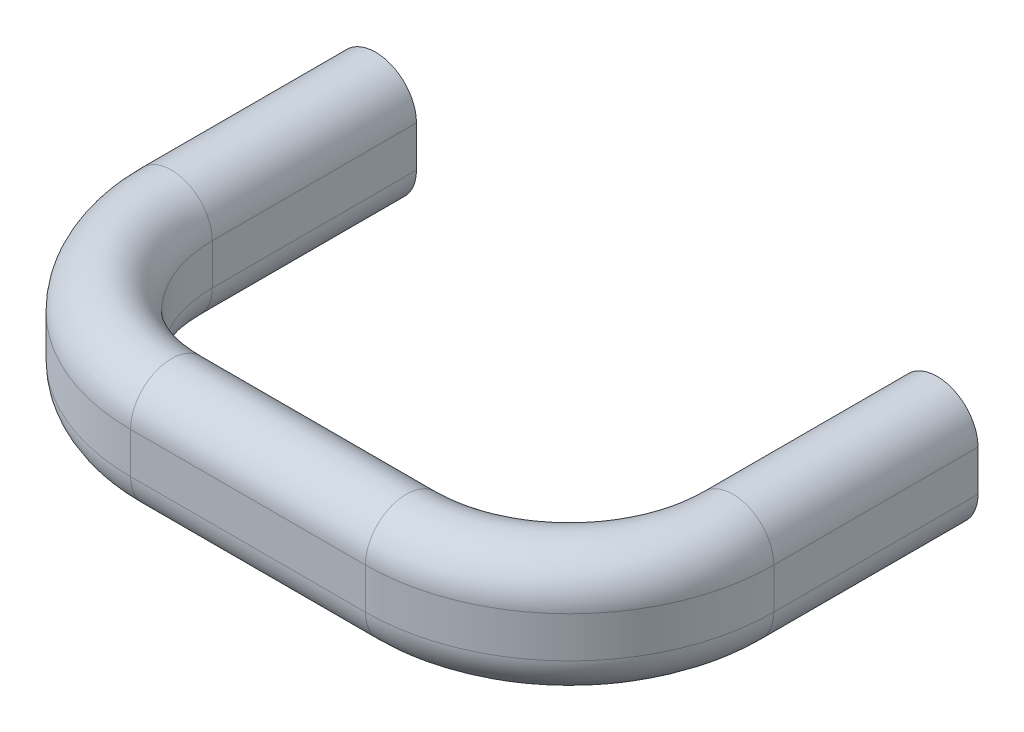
ISO-10303-21;
HEADER;
FILE_DESCRIPTION(('STEP AP214'),'2;1');
FILE_NAME('part.step','',(''),(''),'','','');
FILE_SCHEMA(('AUTOMOTIVE_DESIGN { 1 0 10303 214 1 1 1 1 }'));
ENDSEC;
DATA;
#1=APPLICATION_CONTEXT('core data for automotive mechanical design processes');
#2=APPLICATION_PROTOCOL_DEFINITION('international standard','automotive_design',2000,#1);
#3=PRODUCT_CONTEXT('',#1,'mechanical');
#4=PRODUCT('Part','Part','',(#3));
#5=PRODUCT_RELATED_PRODUCT_CATEGORY('part','',(#4));
#6=PRODUCT_DEFINITION_FORMATION('','',#4);
#7=PRODUCT_DEFINITION_CONTEXT('part definition',#1,'design');
#8=PRODUCT_DEFINITION('design','',#6,#7);
#9=PRODUCT_DEFINITION_SHAPE('','',#8);
#10=(LENGTH_UNIT() NAMED_UNIT(*) SI_UNIT(.MILLI.,.METRE.));
#11=(NAMED_UNIT(*) PLANE_ANGLE_UNIT() SI_UNIT($,.RADIAN.));
#12=(NAMED_UNIT(*) SI_UNIT($,.STERADIAN.) SOLID_ANGLE_UNIT());
#13=UNCERTAINTY_MEASURE_WITH_UNIT(LENGTH_MEASURE(1.E-05),#10,'distance_accuracy_value','');
#14=(GEOMETRIC_REPRESENTATION_CONTEXT(3) GLOBAL_UNCERTAINTY_ASSIGNED_CONTEXT((#13)) GLOBAL_UNIT_ASSIGNED_CONTEXT((#10,
#11,#12)) REPRESENTATION_CONTEXT('',''));
#15=CARTESIAN_POINT('',(0.,0.,0.));
#16=DIRECTION('',(0.,0.,1.));
#17=DIRECTION('',(1.,0.,0.));
#18=AXIS2_PLACEMENT_3D('',#15,#16,#17);
#19=CARTESIAN_POINT('',(0.,2.,0.));
#20=DIRECTION('',(0.,0.,-1.));
#21=DIRECTION('',(0.,1.,0.));
#22=AXIS2_PLACEMENT_3D('',#19,#20,#21);
#23=PLANE('',#22);
#24=CARTESIAN_POINT('',(0.,2.,0.));
#25=DIRECTION('',(0.,0.,-1.));
#26=DIRECTION('',(0.,1.,0.));
#27=AXIS2_PLACEMENT_3D('',#24,#25,#26);
#28=CIRCLE('',#27,4.);
#29=CARTESIAN_POINT('',(-4.,2.,0.));
#30=VERTEX_POINT('',#29);
#31=CARTESIAN_POINT('',(4.,2.,0.));
#32=VERTEX_POINT('',#31);
#33=EDGE_CURVE('E31',#30,#32,#28,.T.);
#34=ORIENTED_EDGE('',*,*,#33,.T.);
#35=DIRECTION('',(0.,-1.,0.));
#36=VECTOR('',#35,1.);
#37=CARTESIAN_POINT('',(4.,2.,0.));
#38=LINE('',#37,#36);
#39=CARTESIAN_POINT('',(4.,-2.,0.));
#40=VERTEX_POINT('',#39);
#41=EDGE_CURVE('E18',#32,#40,#38,.T.);
#42=ORIENTED_EDGE('',*,*,#41,.T.);
#43=CARTESIAN_POINT('',(0.,-2.,0.));
#44=DIRECTION('',(0.,0.,-1.));
#45=DIRECTION('',(0.,1.,0.));
#46=AXIS2_PLACEMENT_3D('',#43,#44,#45);
#47=CIRCLE('',#46,4.);
#48=CARTESIAN_POINT('',(-4.,-2.,0.));
#49=VERTEX_POINT('',#48);
#50=EDGE_CURVE('E39',#40,#49,#47,.T.);
#51=ORIENTED_EDGE('',*,*,#50,.T.);
#52=DIRECTION('',(0.,-1.,0.));
#53=VECTOR('',#52,1.);
#54=CARTESIAN_POINT('',(-4.,2.,0.));
#55=LINE('',#54,#53);
#56=EDGE_CURVE('E230',#30,#49,#55,.T.);
#57=ORIENTED_EDGE('',*,*,#56,.F.);
#58=EDGE_LOOP('',(#34,#42,#51,#57));
#59=FACE_BOUND('',#58,.T.);
#60=CARTESIAN_POINT('',(0.,0.,-1.89885135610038E-13));
#61=DIRECTION('',(0.,0.,-1.));
#62=DIRECTION('',(0.,1.,0.));
#63=AXIS2_PLACEMENT_3D('',#60,#61,#62);
#64=CIRCLE('',#63,2.96700000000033);
#65=CARTESIAN_POINT('',(0.,2.96700000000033,-1.89885135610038E-13));
#66=VERTEX_POINT('',#65);
#67=EDGE_CURVE('E542',#66,#66,#64,.T.);
#68=ORIENTED_EDGE('',*,*,#67,.F.);
#69=EDGE_LOOP('',(#68));
#70=FACE_BOUND('',#69,.T.);
#71=ADVANCED_FACE('F14',(#59,#70),#23,.T.);
#72=CARTESIAN_POINT('',(55.,2.,0.));
#73=DIRECTION('',(0.,0.,1.));
#74=DIRECTION('',(0.,1.,0.));
#75=AXIS2_PLACEMENT_3D('',#72,#73,#74);
#76=PLANE('',#75);
#77=CARTESIAN_POINT('',(55.,2.,0.));
#78=DIRECTION('',(0.,0.,1.));
#79=DIRECTION('',(0.,1.,0.));
#80=AXIS2_PLACEMENT_3D('',#77,#78,#79);
#81=CIRCLE('',#80,4.);
#82=CARTESIAN_POINT('',(59.,2.,0.));
#83=VERTEX_POINT('',#82);
#84=CARTESIAN_POINT('',(51.,2.,0.));
#85=VERTEX_POINT('',#84);
#86=EDGE_CURVE('E107',#83,#85,#81,.T.);
#87=ORIENTED_EDGE('',*,*,#86,.F.);
#88=DIRECTION('',(0.,-1.,0.));
#89=VECTOR('',#88,1.);
#90=CARTESIAN_POINT('',(59.,2.,0.));
#91=LINE('',#90,#89);
#92=CARTESIAN_POINT('',(59.,-2.,0.));
#93=VERTEX_POINT('',#92);
#94=EDGE_CURVE('E136',#83,#93,#91,.T.);
#95=ORIENTED_EDGE('',*,*,#94,.T.);
#96=CARTESIAN_POINT('',(55.,-2.,0.));
#97=DIRECTION('',(0.,0.,1.));
#98=DIRECTION('',(0.,1.,0.));
#99=AXIS2_PLACEMENT_3D('',#96,#97,#98);
#100=CIRCLE('',#99,4.);
#101=CARTESIAN_POINT('',(51.,-2.,0.));
#102=VERTEX_POINT('',#101);
#103=EDGE_CURVE('E134',#102,#93,#100,.T.);
#104=ORIENTED_EDGE('',*,*,#103,.F.);
#105=DIRECTION('',(0.,-1.,0.));
#106=VECTOR('',#105,1.);
#107=CARTESIAN_POINT('',(51.,2.,0.));
#108=LINE('',#107,#106);
#109=EDGE_CURVE('E119',#85,#102,#108,.T.);
#110=ORIENTED_EDGE('',*,*,#109,.F.);
#111=EDGE_LOOP('',(#87,#95,#104,#110));
#112=FACE_BOUND('',#111,.T.);
#113=CARTESIAN_POINT('',(55.,0.,-1.89885135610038E-13));
#114=DIRECTION('',(0.,0.,1.));
#115=DIRECTION('',(0.,1.,0.));
#116=AXIS2_PLACEMENT_3D('',#113,#114,#115);
#117=CIRCLE('',#116,2.96700000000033);
#118=CARTESIAN_POINT('',(55.,2.96700000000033,-1.89885135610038E-13));
#119=VERTEX_POINT('',#118);
#120=EDGE_CURVE('E120',#119,#119,#117,.T.);
#121=ORIENTED_EDGE('',*,*,#120,.T.);
#122=EDGE_LOOP('',(#121));
#123=FACE_BOUND('',#122,.T.);
#124=ADVANCED_FACE('F132',(#112,#123),#76,.F.);
#125=CARTESIAN_POINT('',(4.,2.,20.));
#126=DIRECTION('',(1.,0.,0.));
#127=DIRECTION('',(0.,1.,0.));
#128=AXIS2_PLACEMENT_3D('',#125,#126,#127);
#129=PLANE('',#128);
#130=DIRECTION('',(0.,-1.,0.));
#131=VECTOR('',#130,1.);
#132=CARTESIAN_POINT('',(4.,2.,20.));
#133=LINE('',#132,#131);
#134=CARTESIAN_POINT('',(4.,2.,20.));
#135=VERTEX_POINT('',#134);
#136=CARTESIAN_POINT('',(4.,-2.,20.));
#137=VERTEX_POINT('',#136);
#138=EDGE_CURVE('E204',#135,#137,#133,.T.);
#139=ORIENTED_EDGE('',*,*,#138,.T.);
#140=DIRECTION('',(0.,0.,-1.));
#141=VECTOR('',#140,1.);
#142=CARTESIAN_POINT('',(4.,-2.,20.));
#143=LINE('',#142,#141);
#144=EDGE_CURVE('E23',#137,#40,#143,.T.);
#145=ORIENTED_EDGE('',*,*,#144,.T.);
#146=ORIENTED_EDGE('',*,*,#41,.F.);
#147=DIRECTION('',(0.,0.,-1.));
#148=VECTOR('',#147,1.);
#149=CARTESIAN_POINT('',(4.,2.,20.));
#150=LINE('',#149,#148);
#151=EDGE_CURVE('E9',#135,#32,#150,.T.);
#152=ORIENTED_EDGE('',*,*,#151,.F.);
#153=EDGE_LOOP('',(#139,#145,#146,#152));
#154=FACE_BOUND('',#153,.T.);
#155=ADVANCED_FACE('F16',(#154),#129,.T.);
#156=CARTESIAN_POINT('',(0.,-2.,20.));
#157=DIRECTION('',(0.,0.,-1.));
#158=DIRECTION('',(0.,-1.,0.));
#159=AXIS2_PLACEMENT_3D('',#156,#157,#158);
#160=CYLINDRICAL_SURFACE('',#159,4.);
#161=CARTESIAN_POINT('',(0.,-2.,20.));
#162=DIRECTION('',(0.,0.,-1.));
#163=DIRECTION('',(0.,1.,0.));
#164=AXIS2_PLACEMENT_3D('',#161,#162,#163);
#165=CIRCLE('',#164,4.);
#166=CARTESIAN_POINT('',(-4.,-2.,20.));
#167=VERTEX_POINT('',#166);
#168=EDGE_CURVE('E217',#137,#167,#165,.T.);
#169=ORIENTED_EDGE('',*,*,#168,.T.);
#170=DIRECTION('',(0.,0.,-1.));
#171=VECTOR('',#170,1.);
#172=CARTESIAN_POINT('',(-4.,-2.,20.));
#173=LINE('',#172,#171);
#174=EDGE_CURVE('E225',#167,#49,#173,.T.);
#175=ORIENTED_EDGE('',*,*,#174,.T.);
#176=ORIENTED_EDGE('',*,*,#50,.F.);
#177=ORIENTED_EDGE('',*,*,#144,.F.);
#178=EDGE_LOOP('',(#169,#175,#176,#177));
#179=FACE_BOUND('',#178,.T.);
#180=ADVANCED_FACE('F235',(#179),#160,.T.);
#181=CARTESIAN_POINT('',(-4.,2.,20.));
#182=DIRECTION('',(1.,0.,0.));
#183=DIRECTION('',(0.,1.,0.));
#184=AXIS2_PLACEMENT_3D('',#181,#182,#183);
#185=PLANE('',#184);
#186=DIRECTION('',(0.,-1.,0.));
#187=VECTOR('',#186,1.);
#188=CARTESIAN_POINT('',(-4.,2.,20.));
#189=LINE('',#188,#187);
#190=CARTESIAN_POINT('',(-4.,2.,20.));
#191=VERTEX_POINT('',#190);
#192=EDGE_CURVE('E214',#191,#167,#189,.T.);
#193=ORIENTED_EDGE('',*,*,#192,.F.);
#194=DIRECTION('',(0.,0.,-1.));
#195=VECTOR('',#194,1.);
#196=CARTESIAN_POINT('',(-4.,2.,20.));
#197=LINE('',#196,#195);
#198=EDGE_CURVE('E222',#191,#30,#197,.T.);
#199=ORIENTED_EDGE('',*,*,#198,.T.);
#200=ORIENTED_EDGE('',*,*,#56,.T.);
#201=ORIENTED_EDGE('',*,*,#174,.F.);
#202=EDGE_LOOP('',(#193,#199,#200,#201));
#203=FACE_BOUND('',#202,.T.);
#204=ADVANCED_FACE('F291',(#203),#185,.F.);
#205=CARTESIAN_POINT('',(0.,2.,20.));
#206=DIRECTION('',(0.,0.,-1.));
#207=DIRECTION('',(0.,-1.,0.));
#208=AXIS2_PLACEMENT_3D('',#205,#206,#207);
#209=CYLINDRICAL_SURFACE('',#208,4.);
#210=CARTESIAN_POINT('',(0.,2.,20.));
#211=DIRECTION('',(0.,0.,-1.));
#212=DIRECTION('',(0.,1.,0.));
#213=AXIS2_PLACEMENT_3D('',#210,#211,#212);
#214=CIRCLE('',#213,4.);
#215=EDGE_CURVE('E190',#191,#135,#214,.T.);
#216=ORIENTED_EDGE('',*,*,#215,.T.);
#217=ORIENTED_EDGE('',*,*,#151,.T.);
#218=ORIENTED_EDGE('',*,*,#33,.F.);
#219=ORIENTED_EDGE('',*,*,#198,.F.);
#220=EDGE_LOOP('',(#216,#217,#218,#219));
#221=FACE_BOUND('',#220,.T.);
#222=ADVANCED_FACE('F283',(#221),#209,.T.);
#223=CARTESIAN_POINT('',(16.,0.,20.));
#224=DIRECTION('',(0.,-1.,0.));
#225=DIRECTION('',(1.,0.,0.));
#226=AXIS2_PLACEMENT_3D('',#223,#224,#225);
#227=CYLINDRICAL_SURFACE('',#226,12.);
#228=DIRECTION('',(0.,-1.,0.));
#229=VECTOR('',#228,1.);
#230=CARTESIAN_POINT('',(16.,2.,32.));
#231=LINE('',#230,#229);
#232=CARTESIAN_POINT('',(16.,2.,32.));
#233=VERTEX_POINT('',#232);
#234=CARTESIAN_POINT('',(16.,-2.,32.));
#235=VERTEX_POINT('',#234);
#236=EDGE_CURVE('E181',#233,#235,#231,.T.);
#237=ORIENTED_EDGE('',*,*,#236,.T.);
#238=CARTESIAN_POINT('',(16.,-2.,20.));
#239=DIRECTION('',(0.,-1.,0.));
#240=DIRECTION('',(1.,0.,0.));
#241=AXIS2_PLACEMENT_3D('',#238,#239,#240);
#242=CIRCLE('',#241,12.);
#243=EDGE_CURVE('E207',#235,#137,#242,.T.);
#244=ORIENTED_EDGE('',*,*,#243,.T.);
#245=ORIENTED_EDGE('',*,*,#138,.F.);
#246=CARTESIAN_POINT('',(16.,2.,20.));
#247=DIRECTION('',(0.,-1.,0.));
#248=DIRECTION('',(1.,0.,0.));
#249=AXIS2_PLACEMENT_3D('',#246,#247,#248);
#250=CIRCLE('',#249,12.);
#251=EDGE_CURVE('E210',#233,#135,#250,.T.);
#252=ORIENTED_EDGE('',*,*,#251,.F.);
#253=EDGE_LOOP('',(#237,#244,#245,#252));
#254=FACE_BOUND('',#253,.T.);
#255=ADVANCED_FACE('F281',(#254),#227,.F.);
#256=CARTESIAN_POINT('',(16.,-2.,20.));
#257=DIRECTION('',(0.,-1.,0.));
#258=DIRECTION('',(1.,0.,0.));
#259=AXIS2_PLACEMENT_3D('',#256,#257,#258);
#260=TOROIDAL_SURFACE('',#259,16.,4.);
#261=CARTESIAN_POINT('',(16.,-2.,36.));
#262=DIRECTION('',(-1.,0.,0.));
#263=DIRECTION('',(0.,1.,0.));
#264=AXIS2_PLACEMENT_3D('',#261,#262,#263);
#265=CIRCLE('',#264,4.);
#266=CARTESIAN_POINT('',(16.,-2.,40.));
#267=VERTEX_POINT('',#266);
#268=EDGE_CURVE('E195',#235,#267,#265,.T.);
#269=ORIENTED_EDGE('',*,*,#268,.T.);
#270=CARTESIAN_POINT('',(16.,-2.,20.));
#271=DIRECTION('',(0.,-1.,0.));
#272=DIRECTION('',(1.,0.,0.));
#273=AXIS2_PLACEMENT_3D('',#270,#271,#272);
#274=CIRCLE('',#273,20.);
#275=EDGE_CURVE('E203',#267,#167,#274,.T.);
#276=ORIENTED_EDGE('',*,*,#275,.T.);
#277=ORIENTED_EDGE('',*,*,#168,.F.);
#278=ORIENTED_EDGE('',*,*,#243,.F.);
#279=EDGE_LOOP('',(#269,#276,#277,#278));
#280=FACE_BOUND('',#279,.T.);
#281=ADVANCED_FACE('F244',(#280),#260,.T.);
#282=CARTESIAN_POINT('',(16.,0.,20.));
#283=DIRECTION('',(0.,-1.,0.));
#284=DIRECTION('',(1.,0.,0.));
#285=AXIS2_PLACEMENT_3D('',#282,#283,#284);
#286=CYLINDRICAL_SURFACE('',#285,20.);
#287=DIRECTION('',(0.,-1.,0.));
#288=VECTOR('',#287,1.);
#289=CARTESIAN_POINT('',(16.,2.,40.));
#290=LINE('',#289,#288);
#291=CARTESIAN_POINT('',(16.,2.,40.));
#292=VERTEX_POINT('',#291);
#293=EDGE_CURVE('E192',#292,#267,#290,.T.);
#294=ORIENTED_EDGE('',*,*,#293,.F.);
#295=CARTESIAN_POINT('',(16.,2.,20.));
#296=DIRECTION('',(0.,-1.,0.));
#297=DIRECTION('',(1.,0.,0.));
#298=AXIS2_PLACEMENT_3D('',#295,#296,#297);
#299=CIRCLE('',#298,20.);
#300=EDGE_CURVE('E200',#292,#191,#299,.T.);
#301=ORIENTED_EDGE('',*,*,#300,.T.);
#302=ORIENTED_EDGE('',*,*,#192,.T.);
#303=ORIENTED_EDGE('',*,*,#275,.F.);
#304=EDGE_LOOP('',(#294,#301,#302,#303));
#305=FACE_BOUND('',#304,.T.);
#306=ADVANCED_FACE('F241',(#305),#286,.T.);
#307=CARTESIAN_POINT('',(16.,2.,20.));
#308=DIRECTION('',(0.,-1.,0.));
#309=DIRECTION('',(1.,0.,0.));
#310=AXIS2_PLACEMENT_3D('',#307,#308,#309);
#311=TOROIDAL_SURFACE('',#310,16.,4.);
#312=CARTESIAN_POINT('',(16.,2.,36.));
#313=DIRECTION('',(-1.,0.,0.));
#314=DIRECTION('',(0.,1.,0.));
#315=AXIS2_PLACEMENT_3D('',#312,#313,#314);
#316=CIRCLE('',#315,4.);
#317=EDGE_CURVE('E167',#292,#233,#316,.T.);
#318=ORIENTED_EDGE('',*,*,#317,.T.);
#319=ORIENTED_EDGE('',*,*,#251,.T.);
#320=ORIENTED_EDGE('',*,*,#215,.F.);
#321=ORIENTED_EDGE('',*,*,#300,.F.);
#322=EDGE_LOOP('',(#318,#319,#320,#321));
#323=FACE_BOUND('',#322,.T.);
#324=ADVANCED_FACE('F279',(#323),#311,.T.);
#325=CARTESIAN_POINT('',(39.,2.,32.));
#326=DIRECTION('',(0.,0.,-1.));
#327=DIRECTION('',(0.,-1.,0.));
#328=AXIS2_PLACEMENT_3D('',#325,#326,#327);
#329=PLANE('',#328);
#330=DIRECTION('',(0.,-1.,0.));
#331=VECTOR('',#330,1.);
#332=CARTESIAN_POINT('',(39.,2.,32.));
#333=LINE('',#332,#331);
#334=CARTESIAN_POINT('',(39.,2.,32.));
#335=VERTEX_POINT('',#334);
#336=CARTESIAN_POINT('',(39.,-2.,32.));
#337=VERTEX_POINT('',#336);
#338=EDGE_CURVE('E158',#335,#337,#333,.T.);
#339=ORIENTED_EDGE('',*,*,#338,.T.);
#340=DIRECTION('',(-1.,0.,0.));
#341=VECTOR('',#340,1.);
#342=CARTESIAN_POINT('',(39.,-2.,32.));
#343=LINE('',#342,#341);
#344=EDGE_CURVE('E184',#337,#235,#343,.T.);
#345=ORIENTED_EDGE('',*,*,#344,.T.);
#346=ORIENTED_EDGE('',*,*,#236,.F.);
#347=DIRECTION('',(-1.,0.,0.));
#348=VECTOR('',#347,1.);
#349=CARTESIAN_POINT('',(39.,2.,32.));
#350=LINE('',#349,#348);
#351=EDGE_CURVE('E187',#335,#233,#350,.T.);
#352=ORIENTED_EDGE('',*,*,#351,.F.);
#353=EDGE_LOOP('',(#339,#345,#346,#352));
#354=FACE_BOUND('',#353,.T.);
#355=ADVANCED_FACE('F273',(#354),#329,.T.);
#356=CARTESIAN_POINT('',(39.,-2.,36.));
#357=DIRECTION('',(-1.,0.,0.));
#358=DIRECTION('',(0.,-1.,0.));
#359=AXIS2_PLACEMENT_3D('',#356,#357,#358);
#360=CYLINDRICAL_SURFACE('',#359,4.);
#361=CARTESIAN_POINT('',(39.,-2.,36.));
#362=DIRECTION('',(-1.,0.,0.));
#363=DIRECTION('',(0.,1.,0.));
#364=AXIS2_PLACEMENT_3D('',#361,#362,#363);
#365=CIRCLE('',#364,4.);
#366=CARTESIAN_POINT('',(39.,-2.,40.));
#367=VERTEX_POINT('',#366);
#368=EDGE_CURVE('E172',#337,#367,#365,.T.);
#369=ORIENTED_EDGE('',*,*,#368,.T.);
#370=DIRECTION('',(-1.,0.,0.));
#371=VECTOR('',#370,1.);
#372=CARTESIAN_POINT('',(39.,-2.,40.));
#373=LINE('',#372,#371);
#374=EDGE_CURVE('E180',#367,#267,#373,.T.);
#375=ORIENTED_EDGE('',*,*,#374,.T.);
#376=ORIENTED_EDGE('',*,*,#268,.F.);
#377=ORIENTED_EDGE('',*,*,#344,.F.);
#378=EDGE_LOOP('',(#369,#375,#376,#377));
#379=FACE_BOUND('',#378,.T.);
#380=ADVANCED_FACE('F251',(#379),#360,.T.);
#381=CARTESIAN_POINT('',(39.,2.,40.));
#382=DIRECTION('',(0.,0.,-1.));
#383=DIRECTION('',(0.,-1.,0.));
#384=AXIS2_PLACEMENT_3D('',#381,#382,#383);
#385=PLANE('',#384);
#386=DIRECTION('',(0.,-1.,0.));
#387=VECTOR('',#386,1.);
#388=CARTESIAN_POINT('',(39.,2.,40.));
#389=LINE('',#388,#387);
#390=CARTESIAN_POINT('',(39.,2.,40.));
#391=VERTEX_POINT('',#390);
#392=EDGE_CURVE('E169',#391,#367,#389,.T.);
#393=ORIENTED_EDGE('',*,*,#392,.F.);
#394=DIRECTION('',(-1.,0.,0.));
#395=VECTOR('',#394,1.);
#396=CARTESIAN_POINT('',(39.,2.,40.));
#397=LINE('',#396,#395);
#398=EDGE_CURVE('E177',#391,#292,#397,.T.);
#399=ORIENTED_EDGE('',*,*,#398,.T.);
#400=ORIENTED_EDGE('',*,*,#293,.T.);
#401=ORIENTED_EDGE('',*,*,#374,.F.);
#402=EDGE_LOOP('',(#393,#399,#400,#401));
#403=FACE_BOUND('',#402,.T.);
#404=ADVANCED_FACE('F249',(#403),#385,.F.);
#405=CARTESIAN_POINT('',(39.,2.,36.));
#406=DIRECTION('',(-1.,0.,0.));
#407=DIRECTION('',(0.,-1.,0.));
#408=AXIS2_PLACEMENT_3D('',#405,#406,#407);
#409=CYLINDRICAL_SURFACE('',#408,4.);
#410=CARTESIAN_POINT('',(39.,2.,36.));
#411=DIRECTION('',(-1.,0.,0.));
#412=DIRECTION('',(0.,1.,0.));
#413=AXIS2_PLACEMENT_3D('',#410,#411,#412);
#414=CIRCLE('',#413,4.);
#415=EDGE_CURVE('E129',#391,#335,#414,.T.);
#416=ORIENTED_EDGE('',*,*,#415,.T.);
#417=ORIENTED_EDGE('',*,*,#351,.T.);
#418=ORIENTED_EDGE('',*,*,#317,.F.);
#419=ORIENTED_EDGE('',*,*,#398,.F.);
#420=EDGE_LOOP('',(#416,#417,#418,#419));
#421=FACE_BOUND('',#420,.T.);
#422=ADVANCED_FACE('F276',(#421),#409,.T.);
#423=CARTESIAN_POINT('',(39.,0.,20.));
#424=DIRECTION('',(0.,-1.,0.));
#425=DIRECTION('',(1.,0.,0.));
#426=AXIS2_PLACEMENT_3D('',#423,#424,#425);
#427=CYLINDRICAL_SURFACE('',#426,12.);
#428=DIRECTION('',(0.,-1.,0.));
#429=VECTOR('',#428,1.);
#430=CARTESIAN_POINT('',(51.,2.,20.));
#431=LINE('',#430,#429);
#432=CARTESIAN_POINT('',(51.,2.,20.));
#433=VERTEX_POINT('',#432);
#434=CARTESIAN_POINT('',(51.,-2.,20.));
#435=VERTEX_POINT('',#434);
#436=EDGE_CURVE('E128',#433,#435,#431,.T.);
#437=ORIENTED_EDGE('',*,*,#436,.T.);
#438=CARTESIAN_POINT('',(39.,-2.,20.));
#439=DIRECTION('',(0.,-1.,0.));
#440=DIRECTION('',(1.,0.,0.));
#441=AXIS2_PLACEMENT_3D('',#438,#439,#440);
#442=CIRCLE('',#441,12.);
#443=EDGE_CURVE('E161',#435,#337,#442,.T.);
#444=ORIENTED_EDGE('',*,*,#443,.T.);
#445=ORIENTED_EDGE('',*,*,#338,.F.);
#446=CARTESIAN_POINT('',(39.,2.,20.));
#447=DIRECTION('',(0.,-1.,0.));
#448=DIRECTION('',(1.,0.,0.));
#449=AXIS2_PLACEMENT_3D('',#446,#447,#448);
#450=CIRCLE('',#449,12.);
#451=EDGE_CURVE('E164',#433,#335,#450,.T.);
#452=ORIENTED_EDGE('',*,*,#451,.F.);
#453=EDGE_LOOP('',(#437,#444,#445,#452));
#454=FACE_BOUND('',#453,.T.);
#455=ADVANCED_FACE('F270',(#454),#427,.F.);
#456=CARTESIAN_POINT('',(39.,-2.,20.));
#457=DIRECTION('',(0.,-1.,0.));
#458=DIRECTION('',(1.,0.,0.));
#459=AXIS2_PLACEMENT_3D('',#456,#457,#458);
#460=TOROIDAL_SURFACE('',#459,16.,4.);
#461=CARTESIAN_POINT('',(55.,-2.,20.));
#462=DIRECTION('',(0.,0.,1.));
#463=DIRECTION('',(0.,1.,0.));
#464=AXIS2_PLACEMENT_3D('',#461,#462,#463);
#465=CIRCLE('',#464,4.);
#466=CARTESIAN_POINT('',(59.,-2.,20.));
#467=VERTEX_POINT('',#466);
#468=EDGE_CURVE('E144',#435,#467,#465,.T.);
#469=ORIENTED_EDGE('',*,*,#468,.T.);
#470=CARTESIAN_POINT('',(39.,-2.,20.));
#471=DIRECTION('',(0.,-1.,0.));
#472=DIRECTION('',(1.,0.,0.));
#473=AXIS2_PLACEMENT_3D('',#470,#471,#472);
#474=CIRCLE('',#473,20.);
#475=EDGE_CURVE('E157',#467,#367,#474,.T.);
#476=ORIENTED_EDGE('',*,*,#475,.T.);
#477=ORIENTED_EDGE('',*,*,#368,.F.);
#478=ORIENTED_EDGE('',*,*,#443,.F.);
#479=EDGE_LOOP('',(#469,#476,#477,#478));
#480=FACE_BOUND('',#479,.T.);
#481=ADVANCED_FACE('F259',(#480),#460,.T.);
#482=CARTESIAN_POINT('',(39.,0.,20.));
#483=DIRECTION('',(0.,-1.,0.));
#484=DIRECTION('',(1.,0.,0.));
#485=AXIS2_PLACEMENT_3D('',#482,#483,#484);
#486=CYLINDRICAL_SURFACE('',#485,20.);
#487=DIRECTION('',(0.,-1.,0.));
#488=VECTOR('',#487,1.);
#489=CARTESIAN_POINT('',(59.,2.,20.));
#490=LINE('',#489,#488);
#491=CARTESIAN_POINT('',(59.,2.,20.));
#492=VERTEX_POINT('',#491);
#493=EDGE_CURVE('E146',#492,#467,#490,.T.);
#494=ORIENTED_EDGE('',*,*,#493,.F.);
#495=CARTESIAN_POINT('',(39.,2.,20.));
#496=DIRECTION('',(0.,-1.,0.));
#497=DIRECTION('',(1.,0.,0.));
#498=AXIS2_PLACEMENT_3D('',#495,#496,#497);
#499=CIRCLE('',#498,20.);
#500=EDGE_CURVE('E154',#492,#391,#499,.T.);
#501=ORIENTED_EDGE('',*,*,#500,.T.);
#502=ORIENTED_EDGE('',*,*,#392,.T.);
#503=ORIENTED_EDGE('',*,*,#475,.F.);
#504=EDGE_LOOP('',(#494,#501,#502,#503));
#505=FACE_BOUND('',#504,.T.);
#506=ADVANCED_FACE('F256',(#505),#486,.T.);
#507=CARTESIAN_POINT('',(39.,2.,20.));
#508=DIRECTION('',(0.,-1.,0.));
#509=DIRECTION('',(1.,0.,0.));
#510=AXIS2_PLACEMENT_3D('',#507,#508,#509);
#511=TOROIDAL_SURFACE('',#510,16.,4.);
#512=CARTESIAN_POINT('',(55.,2.,20.));
#513=DIRECTION('',(0.,0.,1.));
#514=DIRECTION('',(0.,1.,0.));
#515=AXIS2_PLACEMENT_3D('',#512,#513,#514);
#516=CIRCLE('',#515,4.);
#517=EDGE_CURVE('E141',#492,#433,#516,.T.);
#518=ORIENTED_EDGE('',*,*,#517,.T.);
#519=ORIENTED_EDGE('',*,*,#451,.T.);
#520=ORIENTED_EDGE('',*,*,#415,.F.);
#521=ORIENTED_EDGE('',*,*,#500,.F.);
#522=EDGE_LOOP('',(#518,#519,#520,#521));
#523=FACE_BOUND('',#522,.T.);
#524=ADVANCED_FACE('F267',(#523),#511,.T.);
#525=CARTESIAN_POINT('',(55.,2.,20.));
#526=DIRECTION('',(0.,0.,-1.));
#527=DIRECTION('',(0.,-1.,0.));
#528=AXIS2_PLACEMENT_3D('',#525,#526,#527);
#529=CYLINDRICAL_SURFACE('',#528,4.);
#530=DIRECTION('',(0.,0.,-1.));
#531=VECTOR('',#530,1.);
#532=CARTESIAN_POINT('',(51.,2.,20.));
#533=LINE('',#532,#531);
#534=EDGE_CURVE('E111',#433,#85,#533,.T.);
#535=ORIENTED_EDGE('',*,*,#534,.F.);
#536=ORIENTED_EDGE('',*,*,#517,.F.);
#537=DIRECTION('',(0.,0.,-1.));
#538=VECTOR('',#537,1.);
#539=CARTESIAN_POINT('',(59.,2.,20.));
#540=LINE('',#539,#538);
#541=EDGE_CURVE('E114',#492,#83,#540,.T.);
#542=ORIENTED_EDGE('',*,*,#541,.T.);
#543=ORIENTED_EDGE('',*,*,#86,.T.);
#544=EDGE_LOOP('',(#535,#536,#542,#543));
#545=FACE_BOUND('',#544,.T.);
#546=ADVANCED_FACE('F109',(#545),#529,.T.);
#547=CARTESIAN_POINT('',(51.,2.,20.));
#548=DIRECTION('',(1.,0.,0.));
#549=DIRECTION('',(0.,1.,0.));
#550=AXIS2_PLACEMENT_3D('',#547,#548,#549);
#551=PLANE('',#550);
#552=DIRECTION('',(0.,0.,-1.));
#553=VECTOR('',#552,1.);
#554=CARTESIAN_POINT('',(51.,-2.,20.));
#555=LINE('',#554,#553);
#556=EDGE_CURVE('E130',#435,#102,#555,.T.);
#557=ORIENTED_EDGE('',*,*,#556,.F.);
#558=ORIENTED_EDGE('',*,*,#436,.F.);
#559=ORIENTED_EDGE('',*,*,#534,.T.);
#560=ORIENTED_EDGE('',*,*,#109,.T.);
#561=EDGE_LOOP('',(#557,#558,#559,#560));
#562=FACE_BOUND('',#561,.T.);
#563=ADVANCED_FACE('F125',(#562),#551,.F.);
#564=CARTESIAN_POINT('',(55.,-2.,20.));
#565=DIRECTION('',(0.,0.,-1.));
#566=DIRECTION('',(0.,-1.,0.));
#567=AXIS2_PLACEMENT_3D('',#564,#565,#566);
#568=CYLINDRICAL_SURFACE('',#567,4.);
#569=DIRECTION('',(0.,0.,-1.));
#570=VECTOR('',#569,1.);
#571=CARTESIAN_POINT('',(59.,-2.,20.));
#572=LINE('',#571,#570);
#573=EDGE_CURVE('E150',#467,#93,#572,.T.);
#574=ORIENTED_EDGE('',*,*,#573,.F.);
#575=ORIENTED_EDGE('',*,*,#468,.F.);
#576=ORIENTED_EDGE('',*,*,#556,.T.);
#577=ORIENTED_EDGE('',*,*,#103,.T.);
#578=EDGE_LOOP('',(#574,#575,#576,#577));
#579=FACE_BOUND('',#578,.T.);
#580=ADVANCED_FACE('F262',(#579),#568,.T.);
#581=CARTESIAN_POINT('',(59.,2.,20.));
#582=DIRECTION('',(1.,0.,0.));
#583=DIRECTION('',(0.,1.,0.));
#584=AXIS2_PLACEMENT_3D('',#581,#582,#583);
#585=PLANE('',#584);
#586=ORIENTED_EDGE('',*,*,#493,.T.);
#587=ORIENTED_EDGE('',*,*,#573,.T.);
#588=ORIENTED_EDGE('',*,*,#94,.F.);
#589=ORIENTED_EDGE('',*,*,#541,.F.);
#590=EDGE_LOOP('',(#586,#587,#588,#589));
#591=FACE_BOUND('',#590,.T.);
#592=ADVANCED_FACE('F264',(#591),#585,.T.);
#593=CARTESIAN_POINT('',(55.,0.,-1.89885135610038E-13));
#594=DIRECTION('',(0.,0.,-1.));
#595=DIRECTION('',(0.,-1.,0.));
#596=AXIS2_PLACEMENT_3D('',#593,#594,#595);
#597=CONICAL_SURFACE('',#596,2.96700000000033,0.785398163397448);
#598=CARTESIAN_POINT('',(55.,0.,0.467000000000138));
#599=DIRECTION('',(0.,0.,-1.));
#600=DIRECTION('',(-1.,0.,0.));
#601=AXIS2_PLACEMENT_3D('',#598,#599,#600);
#602=CIRCLE('',#601,2.5);
#603=CARTESIAN_POINT('',(52.5,0.,0.467000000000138));
#604=VERTEX_POINT('',#603);
#605=EDGE_CURVE('E539',#604,#604,#602,.T.);
#606=ORIENTED_EDGE('',*,*,#605,.F.);
#607=EDGE_LOOP('',(#606));
#608=FACE_BOUND('',#607,.T.);
#609=ORIENTED_EDGE('',*,*,#120,.F.);
#610=EDGE_LOOP('',(#609));
#611=FACE_BOUND('',#610,.T.);
#612=ADVANCED_FACE('F304',(#608,#611),#597,.F.);
#613=CARTESIAN_POINT('',(0.,0.,-1.89885135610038E-13));
#614=DIRECTION('',(0.,0.,-1.));
#615=DIRECTION('',(0.,-1.,0.));
#616=AXIS2_PLACEMENT_3D('',#613,#614,#615);
#617=CONICAL_SURFACE('',#616,2.96700000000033,0.785398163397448);
#618=CARTESIAN_POINT('',(0.,0.,0.46700000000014));
#619=DIRECTION('',(0.,0.,-1.));
#620=DIRECTION('',(-1.,0.,0.));
#621=AXIS2_PLACEMENT_3D('',#618,#619,#620);
#622=CIRCLE('',#621,2.5);
#623=CARTESIAN_POINT('',(-2.5,0.,0.46700000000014));
#624=VERTEX_POINT('',#623);
#625=EDGE_CURVE('E531',#624,#624,#622,.T.);
#626=ORIENTED_EDGE('',*,*,#625,.F.);
#627=EDGE_LOOP('',(#626));
#628=FACE_BOUND('',#627,.T.);
#629=ORIENTED_EDGE('',*,*,#67,.T.);
#630=EDGE_LOOP('',(#629));
#631=FACE_BOUND('',#630,.T.);
#632=ADVANCED_FACE('F408',(#628,#631),#617,.F.);
#633=CARTESIAN_POINT('',(55.,0.,10.));
#634=DIRECTION('',(0.,0.,-1.));
#635=DIRECTION('',(-1.,0.,0.));
#636=AXIS2_PLACEMENT_3D('',#633,#634,#635);
#637=CYLINDRICAL_SURFACE('',#636,2.5);
#638=ORIENTED_EDGE('',*,*,#605,.T.);
#639=EDGE_LOOP('',(#638));
#640=FACE_BOUND('',#639,.T.);
#641=CARTESIAN_POINT('',(55.,0.,10.));
#642=DIRECTION('',(0.,0.,-1.));
#643=DIRECTION('',(-1.,0.,0.));
#644=AXIS2_PLACEMENT_3D('',#641,#642,#643);
#645=CIRCLE('',#644,2.5);
#646=CARTESIAN_POINT('',(52.5,0.,10.));
#647=VERTEX_POINT('',#646);
#648=EDGE_CURVE('E534',#647,#647,#645,.T.);
#649=ORIENTED_EDGE('',*,*,#648,.F.);
#650=EDGE_LOOP('',(#649));
#651=FACE_BOUND('',#650,.T.);
#652=ADVANCED_FACE('F416',(#640,#651),#637,.F.);
#653=CARTESIAN_POINT('',(55.,0.,10.));
#654=DIRECTION('',(0.,0.,-1.));
#655=DIRECTION('',(-1.,0.,0.));
#656=AXIS2_PLACEMENT_3D('',#653,#654,#655);
#657=PLANE('',#656);
#658=ORIENTED_EDGE('',*,*,#648,.T.);
#659=EDGE_LOOP('',(#658));
#660=FACE_BOUND('',#659,.T.);
#661=ADVANCED_FACE('F425',(#660),#657,.T.);
#662=CARTESIAN_POINT('',(0.,0.,10.));
#663=DIRECTION('',(0.,0.,-1.));
#664=DIRECTION('',(-1.,0.,0.));
#665=AXIS2_PLACEMENT_3D('',#662,#663,#664);
#666=CYLINDRICAL_SURFACE('',#665,2.5);
#667=ORIENTED_EDGE('',*,*,#625,.T.);
#668=EDGE_LOOP('',(#667));
#669=FACE_BOUND('',#668,.T.);
#670=CARTESIAN_POINT('',(0.,0.,10.));
#671=DIRECTION('',(0.,0.,-1.));
#672=DIRECTION('',(-1.,0.,0.));
#673=AXIS2_PLACEMENT_3D('',#670,#671,#672);
#674=CIRCLE('',#673,2.5);
#675=CARTESIAN_POINT('',(-2.5,0.,10.));
#676=VERTEX_POINT('',#675);
#677=EDGE_CURVE('E529',#676,#676,#674,.T.);
#678=ORIENTED_EDGE('',*,*,#677,.F.);
#679=EDGE_LOOP('',(#678));
#680=FACE_BOUND('',#679,.T.);
#681=ADVANCED_FACE('F434',(#669,#680),#666,.F.);
#682=CARTESIAN_POINT('',(0.,0.,10.));
#683=DIRECTION('',(0.,0.,-1.));
#684=DIRECTION('',(-1.,0.,0.));
#685=AXIS2_PLACEMENT_3D('',#682,#683,#684);
#686=PLANE('',#685);
#687=ORIENTED_EDGE('',*,*,#677,.T.);
#688=EDGE_LOOP('',(#687));
#689=FACE_BOUND('',#688,.T.);
#690=ADVANCED_FACE('F443',(#689),#686,.T.);
#691=CLOSED_SHELL('',(#71,#124,#155,#180,#204,#222,#255,#281,#306,#324,#355,#380,#404,#422,#455,
#481,#506,#524,#546,#563,#580,#592,#612,#632,#652,#661,#681,#690));
#692=MANIFOLD_SOLID_BREP('B1',#691);
#693=ADVANCED_BREP_SHAPE_REPRESENTATION('',(#18,#692),#14);
#694=SHAPE_DEFINITION_REPRESENTATION(#9,#693);
ENDSEC;
END-ISO-10303-21;
